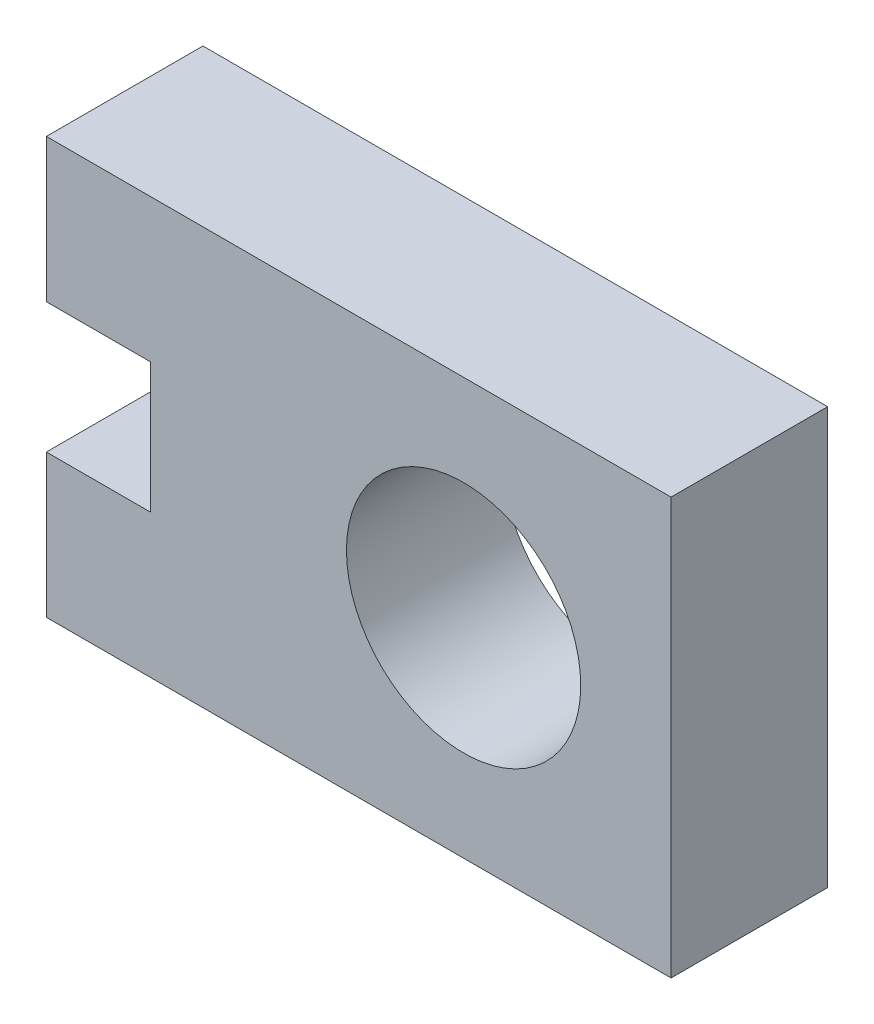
ISO-10303-21;
HEADER;
FILE_DESCRIPTION(('STEP AP214'),'2;1');
FILE_NAME('part.step','',(''),(''),'','','');
FILE_SCHEMA(('AUTOMOTIVE_DESIGN { 1 0 10303 214 1 1 1 1 }'));
ENDSEC;
DATA;
#1=APPLICATION_CONTEXT('core data for automotive mechanical design processes');
#2=APPLICATION_PROTOCOL_DEFINITION('international standard','automotive_design',2000,#1);
#3=PRODUCT_CONTEXT('',#1,'mechanical');
#4=PRODUCT('Part','Part','',(#3));
#5=PRODUCT_RELATED_PRODUCT_CATEGORY('part','',(#4));
#6=PRODUCT_DEFINITION_FORMATION('','',#4);
#7=PRODUCT_DEFINITION_CONTEXT('part definition',#1,'design');
#8=PRODUCT_DEFINITION('design','',#6,#7);
#9=PRODUCT_DEFINITION_SHAPE('','',#8);
#10=(LENGTH_UNIT() NAMED_UNIT(*) SI_UNIT(.MILLI.,.METRE.));
#11=(NAMED_UNIT(*) PLANE_ANGLE_UNIT() SI_UNIT($,.RADIAN.));
#12=(NAMED_UNIT(*) SI_UNIT($,.STERADIAN.) SOLID_ANGLE_UNIT());
#13=UNCERTAINTY_MEASURE_WITH_UNIT(LENGTH_MEASURE(1.E-05),#10,'distance_accuracy_value','');
#14=(GEOMETRIC_REPRESENTATION_CONTEXT(3) GLOBAL_UNCERTAINTY_ASSIGNED_CONTEXT((#13)) GLOBAL_UNIT_ASSIGNED_CONTEXT((#10,
#11,#12)) REPRESENTATION_CONTEXT('',''));
#15=CARTESIAN_POINT('',(0.,0.,0.));
#16=DIRECTION('',(0.,0.,1.));
#17=DIRECTION('',(1.,0.,0.));
#18=AXIS2_PLACEMENT_3D('',#15,#16,#17);
#19=CARTESIAN_POINT('',(19.05,-3.96875,4.7752));
#20=DIRECTION('',(0.,0.,-1.));
#21=DIRECTION('',(-1.,0.,0.));
#22=AXIS2_PLACEMENT_3D('',#19,#20,#21);
#23=PLANE('',#22);
#24=DIRECTION('',(0.,1.,0.));
#25=VECTOR('',#24,1.);
#26=CARTESIAN_POINT('',(19.05,12.7,4.7752));
#27=LINE('',#26,#25);
#28=CARTESIAN_POINT('',(19.05,-12.7,4.7752));
#29=VERTEX_POINT('',#28);
#30=CARTESIAN_POINT('',(19.05,12.7,4.7752));
#31=VERTEX_POINT('',#30);
#32=EDGE_CURVE('E137',#29,#31,#27,.T.);
#33=ORIENTED_EDGE('',*,*,#32,.T.);
#34=DIRECTION('',(-1.,0.,0.));
#35=VECTOR('',#34,1.);
#36=CARTESIAN_POINT('',(19.05,12.7,4.7752));
#37=LINE('',#36,#35);
#38=CARTESIAN_POINT('',(-19.05,12.7,4.7752));
#39=VERTEX_POINT('',#38);
#40=EDGE_CURVE('E98',#31,#39,#37,.T.);
#41=ORIENTED_EDGE('',*,*,#40,.T.);
#42=DIRECTION('',(0.,-1.,0.));
#43=VECTOR('',#42,1.);
#44=CARTESIAN_POINT('',(-19.05,12.7,4.7752));
#45=LINE('',#44,#43);
#46=CARTESIAN_POINT('',(-19.05,3.96875,4.7752));
#47=VERTEX_POINT('',#46);
#48=EDGE_CURVE('E140',#39,#47,#45,.T.);
#49=ORIENTED_EDGE('',*,*,#48,.T.);
#50=DIRECTION('',(1.,0.,0.));
#51=VECTOR('',#50,1.);
#52=CARTESIAN_POINT('',(-12.7,3.96875,4.7752));
#53=LINE('',#52,#51);
#54=CARTESIAN_POINT('',(-12.7,3.96875,4.7752));
#55=VERTEX_POINT('',#54);
#56=EDGE_CURVE('E142',#47,#55,#53,.T.);
#57=ORIENTED_EDGE('',*,*,#56,.T.);
#58=DIRECTION('',(0.,-1.,0.));
#59=VECTOR('',#58,1.);
#60=CARTESIAN_POINT('',(-12.7,3.96875,4.7752));
#61=LINE('',#60,#59);
#62=CARTESIAN_POINT('',(-12.7,-3.96875,4.7752));
#63=VERTEX_POINT('',#62);
#64=EDGE_CURVE('E144',#55,#63,#61,.T.);
#65=ORIENTED_EDGE('',*,*,#64,.T.);
#66=DIRECTION('',(-1.,0.,0.));
#67=VECTOR('',#66,1.);
#68=CARTESIAN_POINT('',(-12.7,-3.96875,4.7752));
#69=LINE('',#68,#67);
#70=CARTESIAN_POINT('',(-19.05,-3.96875,4.7752));
#71=VERTEX_POINT('',#70);
#72=EDGE_CURVE('E146',#63,#71,#69,.T.);
#73=ORIENTED_EDGE('',*,*,#72,.T.);
#74=DIRECTION('',(0.,-1.,0.));
#75=VECTOR('',#74,1.);
#76=CARTESIAN_POINT('',(-19.05,-3.96875,4.7752));
#77=LINE('',#76,#75);
#78=CARTESIAN_POINT('',(-19.05,-12.7,4.7752));
#79=VERTEX_POINT('',#78);
#80=EDGE_CURVE('E50',#71,#79,#77,.T.);
#81=ORIENTED_EDGE('',*,*,#80,.T.);
#82=DIRECTION('',(1.,0.,0.));
#83=VECTOR('',#82,1.);
#84=CARTESIAN_POINT('',(19.05,-12.7,4.7752));
#85=LINE('',#84,#83);
#86=EDGE_CURVE('E45',#79,#29,#85,.T.);
#87=ORIENTED_EDGE('',*,*,#86,.T.);
#88=EDGE_LOOP('',(#33,#41,#49,#57,#65,#73,#81,#87));
#89=FACE_BOUND('',#88,.T.);
#90=CARTESIAN_POINT('',(6.39677266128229,0.,4.7752));
#91=DIRECTION('',(0.,0.,1.));
#92=DIRECTION('',(1.,0.,0.));
#93=AXIS2_PLACEMENT_3D('',#90,#91,#92);
#94=CIRCLE('',#93,7.14375);
#95=CARTESIAN_POINT('',(13.5405226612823,0.,4.7752));
#96=VERTEX_POINT('',#95);
#97=EDGE_CURVE('E134',#96,#96,#94,.T.);
#98=ORIENTED_EDGE('',*,*,#97,.F.);
#99=EDGE_LOOP('',(#98));
#100=FACE_BOUND('',#99,.T.);
#101=ADVANCED_FACE('F30',(#89,#100),#23,.F.);
#102=CARTESIAN_POINT('',(19.05,12.7,4.7752));
#103=DIRECTION('',(-1.,0.,0.));
#104=DIRECTION('',(0.,0.,1.));
#105=AXIS2_PLACEMENT_3D('',#102,#103,#104);
#106=PLANE('',#105);
#107=DIRECTION('',(0.,0.,-1.));
#108=VECTOR('',#107,1.);
#109=CARTESIAN_POINT('',(19.05,-12.7,4.7752));
#110=LINE('',#109,#108);
#111=CARTESIAN_POINT('',(19.05,-12.7,-4.7752));
#112=VERTEX_POINT('',#111);
#113=EDGE_CURVE('E113',#29,#112,#110,.T.);
#114=ORIENTED_EDGE('',*,*,#113,.T.);
#115=DIRECTION('',(0.,1.,0.));
#116=VECTOR('',#115,1.);
#117=CARTESIAN_POINT('',(19.05,12.7,-4.7752));
#118=LINE('',#117,#116);
#119=CARTESIAN_POINT('',(19.05,12.7,-4.7752));
#120=VERTEX_POINT('',#119);
#121=EDGE_CURVE('E107',#112,#120,#118,.T.);
#122=ORIENTED_EDGE('',*,*,#121,.T.);
#123=DIRECTION('',(0.,0.,-1.));
#124=VECTOR('',#123,1.);
#125=CARTESIAN_POINT('',(19.05,12.7,4.7752));
#126=LINE('',#125,#124);
#127=EDGE_CURVE('E11',#31,#120,#126,.T.);
#128=ORIENTED_EDGE('',*,*,#127,.F.);
#129=ORIENTED_EDGE('',*,*,#32,.F.);
#130=EDGE_LOOP('',(#114,#122,#128,#129));
#131=FACE_BOUND('',#130,.T.);
#132=ADVANCED_FACE('F32',(#131),#106,.F.);
#133=CARTESIAN_POINT('',(19.05,12.7,4.7752));
#134=DIRECTION('',(0.,-1.,0.));
#135=DIRECTION('',(1.,0.,0.));
#136=AXIS2_PLACEMENT_3D('',#133,#134,#135);
#137=PLANE('',#136);
#138=ORIENTED_EDGE('',*,*,#127,.T.);
#139=DIRECTION('',(-1.,0.,0.));
#140=VECTOR('',#139,1.);
#141=CARTESIAN_POINT('',(19.05,12.7,-4.7752));
#142=LINE('',#141,#140);
#143=CARTESIAN_POINT('',(-19.05,12.7,-4.7752));
#144=VERTEX_POINT('',#143);
#145=EDGE_CURVE('E97',#120,#144,#142,.T.);
#146=ORIENTED_EDGE('',*,*,#145,.T.);
#147=DIRECTION('',(0.,0.,-1.));
#148=VECTOR('',#147,1.);
#149=CARTESIAN_POINT('',(-19.05,12.7,4.7752));
#150=LINE('',#149,#148);
#151=EDGE_CURVE('E38',#39,#144,#150,.T.);
#152=ORIENTED_EDGE('',*,*,#151,.F.);
#153=ORIENTED_EDGE('',*,*,#40,.F.);
#154=EDGE_LOOP('',(#138,#146,#152,#153));
#155=FACE_BOUND('',#154,.T.);
#156=ADVANCED_FACE('F95',(#155),#137,.F.);
#157=CARTESIAN_POINT('',(-19.05,12.7,4.7752));
#158=DIRECTION('',(1.,0.,0.));
#159=DIRECTION('',(0.,1.,0.));
#160=AXIS2_PLACEMENT_3D('',#157,#158,#159);
#161=PLANE('',#160);
#162=ORIENTED_EDGE('',*,*,#151,.T.);
#163=DIRECTION('',(0.,-1.,0.));
#164=VECTOR('',#163,1.);
#165=CARTESIAN_POINT('',(-19.05,12.7,-4.7752));
#166=LINE('',#165,#164);
#167=CARTESIAN_POINT('',(-19.05,3.96875,-4.7752));
#168=VERTEX_POINT('',#167);
#169=EDGE_CURVE('E111',#144,#168,#166,.T.);
#170=ORIENTED_EDGE('',*,*,#169,.T.);
#171=DIRECTION('',(0.,0.,-1.));
#172=VECTOR('',#171,1.);
#173=CARTESIAN_POINT('',(-19.05,3.96875,4.7752));
#174=LINE('',#173,#172);
#175=EDGE_CURVE('E159',#47,#168,#174,.T.);
#176=ORIENTED_EDGE('',*,*,#175,.F.);
#177=ORIENTED_EDGE('',*,*,#48,.F.);
#178=EDGE_LOOP('',(#162,#170,#176,#177));
#179=FACE_BOUND('',#178,.T.);
#180=ADVANCED_FACE('F162',(#179),#161,.F.);
#181=CARTESIAN_POINT('',(-12.7,3.96875,4.7752));
#182=DIRECTION('',(0.,1.,0.));
#183=DIRECTION('',(0.,0.,1.));
#184=AXIS2_PLACEMENT_3D('',#181,#182,#183);
#185=PLANE('',#184);
#186=ORIENTED_EDGE('',*,*,#175,.T.);
#187=DIRECTION('',(1.,0.,0.));
#188=VECTOR('',#187,1.);
#189=CARTESIAN_POINT('',(-12.7,3.96875,-4.7752));
#190=LINE('',#189,#188);
#191=CARTESIAN_POINT('',(-12.7,3.96875,-4.7752));
#192=VERTEX_POINT('',#191);
#193=EDGE_CURVE('E120',#168,#192,#190,.T.);
#194=ORIENTED_EDGE('',*,*,#193,.T.);
#195=DIRECTION('',(0.,0.,-1.));
#196=VECTOR('',#195,1.);
#197=CARTESIAN_POINT('',(-12.7,3.96875,4.7752));
#198=LINE('',#197,#196);
#199=EDGE_CURVE('E157',#55,#192,#198,.T.);
#200=ORIENTED_EDGE('',*,*,#199,.F.);
#201=ORIENTED_EDGE('',*,*,#56,.F.);
#202=EDGE_LOOP('',(#186,#194,#200,#201));
#203=FACE_BOUND('',#202,.T.);
#204=ADVANCED_FACE('F170',(#203),#185,.F.);
#205=CARTESIAN_POINT('',(-12.7,3.96875,4.7752));
#206=DIRECTION('',(1.,0.,0.));
#207=DIRECTION('',(0.,1.,0.));
#208=AXIS2_PLACEMENT_3D('',#205,#206,#207);
#209=PLANE('',#208);
#210=ORIENTED_EDGE('',*,*,#199,.T.);
#211=DIRECTION('',(0.,-1.,0.));
#212=VECTOR('',#211,1.);
#213=CARTESIAN_POINT('',(-12.7,3.96875,-4.7752));
#214=LINE('',#213,#212);
#215=CARTESIAN_POINT('',(-12.7,-3.96875,-4.7752));
#216=VERTEX_POINT('',#215);
#217=EDGE_CURVE('E123',#192,#216,#214,.T.);
#218=ORIENTED_EDGE('',*,*,#217,.T.);
#219=DIRECTION('',(0.,0.,-1.));
#220=VECTOR('',#219,1.);
#221=CARTESIAN_POINT('',(-12.7,-3.96875,4.7752));
#222=LINE('',#221,#220);
#223=EDGE_CURVE('E155',#63,#216,#222,.T.);
#224=ORIENTED_EDGE('',*,*,#223,.F.);
#225=ORIENTED_EDGE('',*,*,#64,.F.);
#226=EDGE_LOOP('',(#210,#218,#224,#225));
#227=FACE_BOUND('',#226,.T.);
#228=ADVANCED_FACE('F173',(#227),#209,.F.);
#229=CARTESIAN_POINT('',(-12.7,-3.96875,4.7752));
#230=DIRECTION('',(0.,-1.,0.));
#231=DIRECTION('',(0.,0.,-1.));
#232=AXIS2_PLACEMENT_3D('',#229,#230,#231);
#233=PLANE('',#232);
#234=ORIENTED_EDGE('',*,*,#223,.T.);
#235=DIRECTION('',(-1.,0.,0.));
#236=VECTOR('',#235,1.);
#237=CARTESIAN_POINT('',(-12.7,-3.96875,-4.7752));
#238=LINE('',#237,#236);
#239=CARTESIAN_POINT('',(-19.05,-3.96875,-4.7752));
#240=VERTEX_POINT('',#239);
#241=EDGE_CURVE('E126',#216,#240,#238,.T.);
#242=ORIENTED_EDGE('',*,*,#241,.T.);
#243=DIRECTION('',(0.,0.,-1.));
#244=VECTOR('',#243,1.);
#245=CARTESIAN_POINT('',(-19.05,-3.96875,4.7752));
#246=LINE('',#245,#244);
#247=EDGE_CURVE('E153',#71,#240,#246,.T.);
#248=ORIENTED_EDGE('',*,*,#247,.F.);
#249=ORIENTED_EDGE('',*,*,#72,.F.);
#250=EDGE_LOOP('',(#234,#242,#248,#249));
#251=FACE_BOUND('',#250,.T.);
#252=ADVANCED_FACE('F178',(#251),#233,.F.);
#253=CARTESIAN_POINT('',(-19.05,-3.96875,4.7752));
#254=DIRECTION('',(1.,0.,0.));
#255=DIRECTION('',(0.,1.,0.));
#256=AXIS2_PLACEMENT_3D('',#253,#254,#255);
#257=PLANE('',#256);
#258=ORIENTED_EDGE('',*,*,#247,.T.);
#259=DIRECTION('',(0.,-1.,0.));
#260=VECTOR('',#259,1.);
#261=CARTESIAN_POINT('',(-19.05,-3.96875,-4.7752));
#262=LINE('',#261,#260);
#263=CARTESIAN_POINT('',(-19.05,-12.7,-4.7752));
#264=VERTEX_POINT('',#263);
#265=EDGE_CURVE('E129',#240,#264,#262,.T.);
#266=ORIENTED_EDGE('',*,*,#265,.T.);
#267=DIRECTION('',(0.,0.,-1.));
#268=VECTOR('',#267,1.);
#269=CARTESIAN_POINT('',(-19.05,-12.7,4.7752));
#270=LINE('',#269,#268);
#271=EDGE_CURVE('E151',#79,#264,#270,.T.);
#272=ORIENTED_EDGE('',*,*,#271,.F.);
#273=ORIENTED_EDGE('',*,*,#80,.F.);
#274=EDGE_LOOP('',(#258,#266,#272,#273));
#275=FACE_BOUND('',#274,.T.);
#276=ADVANCED_FACE('F181',(#275),#257,.F.);
#277=CARTESIAN_POINT('',(19.05,-12.7,4.7752));
#278=DIRECTION('',(0.,1.,0.));
#279=DIRECTION('',(-1.,0.,0.));
#280=AXIS2_PLACEMENT_3D('',#277,#278,#279);
#281=PLANE('',#280);
#282=ORIENTED_EDGE('',*,*,#271,.T.);
#283=DIRECTION('',(1.,0.,0.));
#284=VECTOR('',#283,1.);
#285=CARTESIAN_POINT('',(19.05,-12.7,-4.7752));
#286=LINE('',#285,#284);
#287=EDGE_CURVE('E132',#264,#112,#286,.T.);
#288=ORIENTED_EDGE('',*,*,#287,.T.);
#289=ORIENTED_EDGE('',*,*,#113,.F.);
#290=ORIENTED_EDGE('',*,*,#86,.F.);
#291=EDGE_LOOP('',(#282,#288,#289,#290));
#292=FACE_BOUND('',#291,.T.);
#293=ADVANCED_FACE('F183',(#292),#281,.F.);
#294=CARTESIAN_POINT('',(6.39677266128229,0.,4.7752));
#295=DIRECTION('',(0.,0.,-1.));
#296=DIRECTION('',(-1.,0.,0.));
#297=AXIS2_PLACEMENT_3D('',#294,#295,#296);
#298=CYLINDRICAL_SURFACE('',#297,7.14375);
#299=ORIENTED_EDGE('',*,*,#97,.T.);
#300=EDGE_LOOP('',(#299));
#301=FACE_BOUND('',#300,.T.);
#302=CARTESIAN_POINT('',(6.39677266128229,0.,-4.7752));
#303=DIRECTION('',(0.,0.,1.));
#304=DIRECTION('',(1.,0.,0.));
#305=AXIS2_PLACEMENT_3D('',#302,#303,#304);
#306=CIRCLE('',#305,7.14375);
#307=CARTESIAN_POINT('',(13.5405226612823,0.,-4.7752));
#308=VERTEX_POINT('',#307);
#309=EDGE_CURVE('E114',#308,#308,#306,.T.);
#310=ORIENTED_EDGE('',*,*,#309,.F.);
#311=EDGE_LOOP('',(#310));
#312=FACE_BOUND('',#311,.T.);
#313=ADVANCED_FACE('F185',(#301,#312),#298,.F.);
#314=CARTESIAN_POINT('',(19.05,-3.96875,-4.7752));
#315=DIRECTION('',(0.,0.,-1.));
#316=DIRECTION('',(-1.,0.,0.));
#317=AXIS2_PLACEMENT_3D('',#314,#315,#316);
#318=PLANE('',#317);
#319=ORIENTED_EDGE('',*,*,#309,.T.);
#320=EDGE_LOOP('',(#319));
#321=FACE_BOUND('',#320,.T.);
#322=ORIENTED_EDGE('',*,*,#121,.F.);
#323=ORIENTED_EDGE('',*,*,#287,.F.);
#324=ORIENTED_EDGE('',*,*,#265,.F.);
#325=ORIENTED_EDGE('',*,*,#241,.F.);
#326=ORIENTED_EDGE('',*,*,#217,.F.);
#327=ORIENTED_EDGE('',*,*,#193,.F.);
#328=ORIENTED_EDGE('',*,*,#169,.F.);
#329=ORIENTED_EDGE('',*,*,#145,.F.);
#330=EDGE_LOOP('',(#322,#323,#324,#325,#326,#327,#328,#329));
#331=FACE_BOUND('',#330,.T.);
#332=ADVANCED_FACE('F105',(#321,#331),#318,.T.);
#333=CLOSED_SHELL('',(#101,#132,#156,#180,#204,#228,#252,#276,#293,#313,#332));
#334=MANIFOLD_SOLID_BREP('B2',#333);
#335=ADVANCED_BREP_SHAPE_REPRESENTATION('',(#18,#334),#14);
#336=SHAPE_DEFINITION_REPRESENTATION(#9,#335);
ENDSEC;
END-ISO-10303-21;
